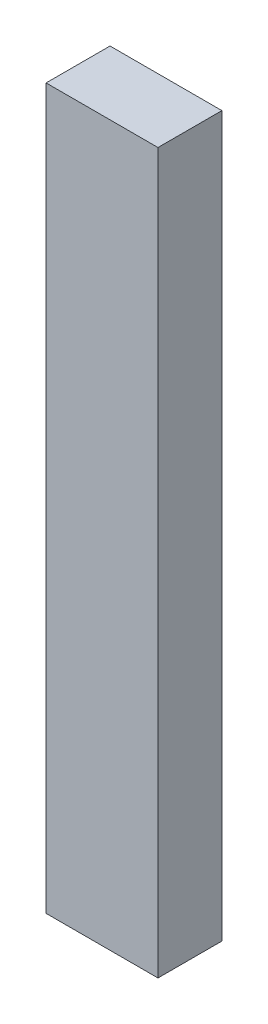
from build123d import *

# Parameters (mm, degrees)
ESQUISSE1_W      = 14
ESQUISSE1_H      = 90
EXTRUSION1_DEPTH = 8


with BuildPart() as part:
    # Esquisse1 → Extrusion1 (new body)
    with BuildSketch(Plane.XY):
        with Locations((7, 45)):
            Rectangle(ESQUISSE1_W, ESQUISSE1_H)
    extrude(amount=EXTRUSION1_DEPTH)


solid = part.part
